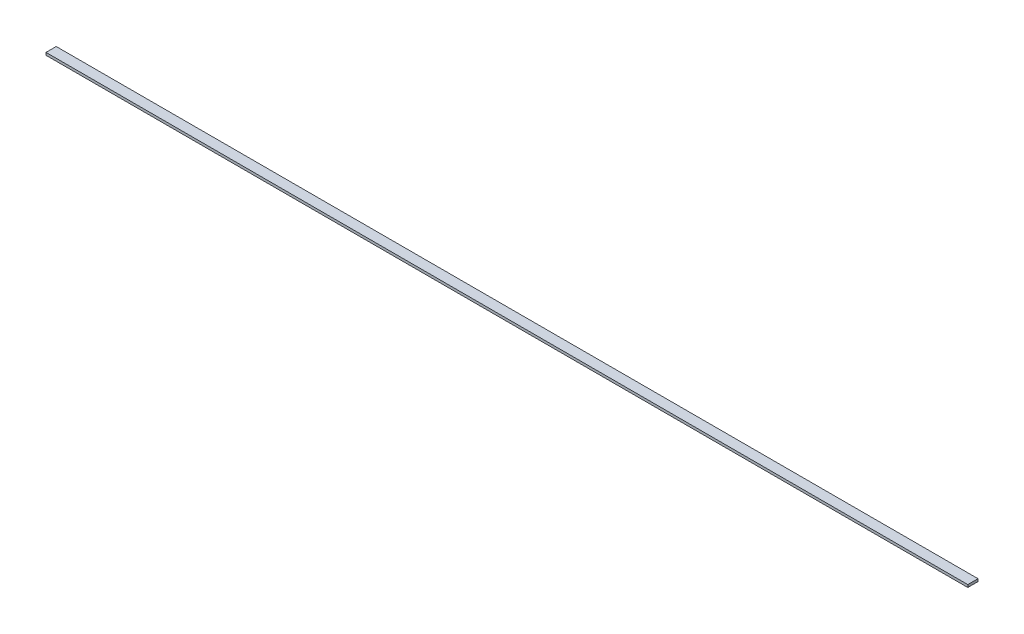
ISO-10303-21;
HEADER;
FILE_DESCRIPTION(('STEP AP214'),'2;1');
FILE_NAME('part.step','',(''),(''),'','','');
FILE_SCHEMA(('AUTOMOTIVE_DESIGN { 1 0 10303 214 1 1 1 1 }'));
ENDSEC;
DATA;
#1=APPLICATION_CONTEXT('core data for automotive mechanical design processes');
#2=APPLICATION_PROTOCOL_DEFINITION('international standard','automotive_design',2000,#1);
#3=PRODUCT_CONTEXT('',#1,'mechanical');
#4=PRODUCT('Part','Part','',(#3));
#5=PRODUCT_RELATED_PRODUCT_CATEGORY('part','',(#4));
#6=PRODUCT_DEFINITION_FORMATION('','',#4);
#7=PRODUCT_DEFINITION_CONTEXT('part definition',#1,'design');
#8=PRODUCT_DEFINITION('design','',#6,#7);
#9=PRODUCT_DEFINITION_SHAPE('','',#8);
#10=(LENGTH_UNIT() NAMED_UNIT(*) SI_UNIT(.MILLI.,.METRE.));
#11=(NAMED_UNIT(*) PLANE_ANGLE_UNIT() SI_UNIT($,.RADIAN.));
#12=(NAMED_UNIT(*) SI_UNIT($,.STERADIAN.) SOLID_ANGLE_UNIT());
#13=UNCERTAINTY_MEASURE_WITH_UNIT(LENGTH_MEASURE(1.E-05),#10,'distance_accuracy_value','');
#14=(GEOMETRIC_REPRESENTATION_CONTEXT(3) GLOBAL_UNCERTAINTY_ASSIGNED_CONTEXT((#13)) GLOBAL_UNIT_ASSIGNED_CONTEXT((#10,
#11,#12)) REPRESENTATION_CONTEXT('',''));
#15=CARTESIAN_POINT('',(0.,0.,0.));
#16=DIRECTION('',(0.,0.,1.));
#17=DIRECTION('',(1.,0.,0.));
#18=AXIS2_PLACEMENT_3D('',#15,#16,#17);
#19=CARTESIAN_POINT('',(1146.175,6.35,12.7));
#20=DIRECTION('',(-1.,0.,0.));
#21=DIRECTION('',(0.,0.,1.));
#22=AXIS2_PLACEMENT_3D('',#19,#20,#21);
#23=PLANE('',#22);
#24=DIRECTION('',(0.,0.,-1.));
#25=VECTOR('',#24,1.);
#26=CARTESIAN_POINT('',(1146.175,0.,12.7));
#27=LINE('',#26,#25);
#28=CARTESIAN_POINT('',(1146.175,0.,12.7));
#29=VERTEX_POINT('',#28);
#30=CARTESIAN_POINT('',(1146.175,0.,-12.7));
#31=VERTEX_POINT('',#30);
#32=EDGE_CURVE('E98',#29,#31,#27,.T.);
#33=ORIENTED_EDGE('',*,*,#32,.T.);
#34=DIRECTION('',(0.,-1.,0.));
#35=VECTOR('',#34,1.);
#36=CARTESIAN_POINT('',(1146.175,6.35,-12.7));
#37=LINE('',#36,#35);
#38=CARTESIAN_POINT('',(1146.175,6.35,-12.7));
#39=VERTEX_POINT('',#38);
#40=EDGE_CURVE('E11',#39,#31,#37,.T.);
#41=ORIENTED_EDGE('',*,*,#40,.F.);
#42=DIRECTION('',(0.,0.,-1.));
#43=VECTOR('',#42,1.);
#44=CARTESIAN_POINT('',(1146.175,6.35,12.7));
#45=LINE('',#44,#43);
#46=CARTESIAN_POINT('',(1146.175,6.35,12.7));
#47=VERTEX_POINT('',#46);
#48=EDGE_CURVE('E86',#47,#39,#45,.T.);
#49=ORIENTED_EDGE('',*,*,#48,.F.);
#50=DIRECTION('',(0.,-1.,0.));
#51=VECTOR('',#50,1.);
#52=CARTESIAN_POINT('',(1146.175,6.35,12.7));
#53=LINE('',#52,#51);
#54=EDGE_CURVE('E94',#47,#29,#53,.T.);
#55=ORIENTED_EDGE('',*,*,#54,.T.);
#56=EDGE_LOOP('',(#33,#41,#49,#55));
#57=FACE_BOUND('',#56,.T.);
#58=ADVANCED_FACE('F35',(#57),#23,.F.);
#59=CARTESIAN_POINT('',(-1146.175,6.35,-12.7));
#60=DIRECTION('',(0.,0.,1.));
#61=DIRECTION('',(1.,0.,0.));
#62=AXIS2_PLACEMENT_3D('',#59,#60,#61);
#63=PLANE('',#62);
#64=DIRECTION('',(-1.,0.,0.));
#65=VECTOR('',#64,1.);
#66=CARTESIAN_POINT('',(-1146.175,0.,-12.7));
#67=LINE('',#66,#65);
#68=CARTESIAN_POINT('',(-1146.175,0.,-12.7));
#69=VERTEX_POINT('',#68);
#70=EDGE_CURVE('E90',#31,#69,#67,.T.);
#71=ORIENTED_EDGE('',*,*,#70,.T.);
#72=DIRECTION('',(0.,-1.,0.));
#73=VECTOR('',#72,1.);
#74=CARTESIAN_POINT('',(-1146.175,6.35,-12.7));
#75=LINE('',#74,#73);
#76=CARTESIAN_POINT('',(-1146.175,6.35,-12.7));
#77=VERTEX_POINT('',#76);
#78=EDGE_CURVE('E43',#77,#69,#75,.T.);
#79=ORIENTED_EDGE('',*,*,#78,.F.);
#80=DIRECTION('',(-1.,0.,0.));
#81=VECTOR('',#80,1.);
#82=CARTESIAN_POINT('',(-1146.175,6.35,-12.7));
#83=LINE('',#82,#81);
#84=EDGE_CURVE('E81',#39,#77,#83,.T.);
#85=ORIENTED_EDGE('',*,*,#84,.F.);
#86=ORIENTED_EDGE('',*,*,#40,.T.);
#87=EDGE_LOOP('',(#71,#79,#85,#86));
#88=FACE_BOUND('',#87,.T.);
#89=ADVANCED_FACE('F89',(#88),#63,.F.);
#90=CARTESIAN_POINT('',(-1146.175,6.35,12.7));
#91=DIRECTION('',(1.,0.,0.));
#92=DIRECTION('',(0.,0.,-1.));
#93=AXIS2_PLACEMENT_3D('',#90,#91,#92);
#94=PLANE('',#93);
#95=DIRECTION('',(0.,0.,1.));
#96=VECTOR('',#95,1.);
#97=CARTESIAN_POINT('',(-1146.175,0.,12.7));
#98=LINE('',#97,#96);
#99=CARTESIAN_POINT('',(-1146.175,0.,12.7));
#100=VERTEX_POINT('',#99);
#101=EDGE_CURVE('E68',#69,#100,#98,.T.);
#102=ORIENTED_EDGE('',*,*,#101,.T.);
#103=DIRECTION('',(0.,-1.,0.));
#104=VECTOR('',#103,1.);
#105=CARTESIAN_POINT('',(-1146.175,6.35,12.7));
#106=LINE('',#105,#104);
#107=CARTESIAN_POINT('',(-1146.175,6.35,12.7));
#108=VERTEX_POINT('',#107);
#109=EDGE_CURVE('E91',#108,#100,#106,.T.);
#110=ORIENTED_EDGE('',*,*,#109,.F.);
#111=DIRECTION('',(0.,0.,1.));
#112=VECTOR('',#111,1.);
#113=CARTESIAN_POINT('',(-1146.175,6.35,12.7));
#114=LINE('',#113,#112);
#115=EDGE_CURVE('E84',#77,#108,#114,.T.);
#116=ORIENTED_EDGE('',*,*,#115,.F.);
#117=ORIENTED_EDGE('',*,*,#78,.T.);
#118=EDGE_LOOP('',(#102,#110,#116,#117));
#119=FACE_BOUND('',#118,.T.);
#120=ADVANCED_FACE('F92',(#119),#94,.F.);
#121=CARTESIAN_POINT('',(-1146.175,6.35,12.7));
#122=DIRECTION('',(0.,0.,-1.));
#123=DIRECTION('',(-1.,0.,0.));
#124=AXIS2_PLACEMENT_3D('',#121,#122,#123);
#125=PLANE('',#124);
#126=DIRECTION('',(1.,0.,0.));
#127=VECTOR('',#126,1.);
#128=CARTESIAN_POINT('',(-1146.175,0.,12.7));
#129=LINE('',#128,#127);
#130=EDGE_CURVE('E74',#100,#29,#129,.T.);
#131=ORIENTED_EDGE('',*,*,#130,.T.);
#132=ORIENTED_EDGE('',*,*,#54,.F.);
#133=DIRECTION('',(1.,0.,0.));
#134=VECTOR('',#133,1.);
#135=CARTESIAN_POINT('',(-1146.175,6.35,12.7));
#136=LINE('',#135,#134);
#137=EDGE_CURVE('E51',#108,#47,#136,.T.);
#138=ORIENTED_EDGE('',*,*,#137,.F.);
#139=ORIENTED_EDGE('',*,*,#109,.T.);
#140=EDGE_LOOP('',(#131,#132,#138,#139));
#141=FACE_BOUND('',#140,.T.);
#142=ADVANCED_FACE('F105',(#141),#125,.F.);
#143=CARTESIAN_POINT('',(0.,6.35,0.));
#144=DIRECTION('',(0.,-1.,0.));
#145=DIRECTION('',(0.,0.,-1.));
#146=AXIS2_PLACEMENT_3D('',#143,#144,#145);
#147=PLANE('',#146);
#148=ORIENTED_EDGE('',*,*,#48,.T.);
#149=ORIENTED_EDGE('',*,*,#84,.T.);
#150=ORIENTED_EDGE('',*,*,#115,.T.);
#151=ORIENTED_EDGE('',*,*,#137,.T.);
#152=EDGE_LOOP('',(#148,#149,#150,#151));
#153=FACE_BOUND('',#152,.T.);
#154=ADVANCED_FACE('F82',(#153),#147,.F.);
#155=CARTESIAN_POINT('',(0.,0.,0.));
#156=DIRECTION('',(0.,-1.,0.));
#157=DIRECTION('',(0.,0.,-1.));
#158=AXIS2_PLACEMENT_3D('',#155,#156,#157);
#159=PLANE('',#158);
#160=ORIENTED_EDGE('',*,*,#32,.F.);
#161=ORIENTED_EDGE('',*,*,#130,.F.);
#162=ORIENTED_EDGE('',*,*,#101,.F.);
#163=ORIENTED_EDGE('',*,*,#70,.F.);
#164=EDGE_LOOP('',(#160,#161,#162,#163));
#165=FACE_BOUND('',#164,.T.);
#166=ADVANCED_FACE('F108',(#165),#159,.T.);
#167=CLOSED_SHELL('',(#58,#89,#120,#142,#154,#166));
#168=MANIFOLD_SOLID_BREP('B2',#167);
#169=ADVANCED_BREP_SHAPE_REPRESENTATION('',(#18,#168),#14);
#170=SHAPE_DEFINITION_REPRESENTATION(#9,#169);
ENDSEC;
END-ISO-10303-21;
